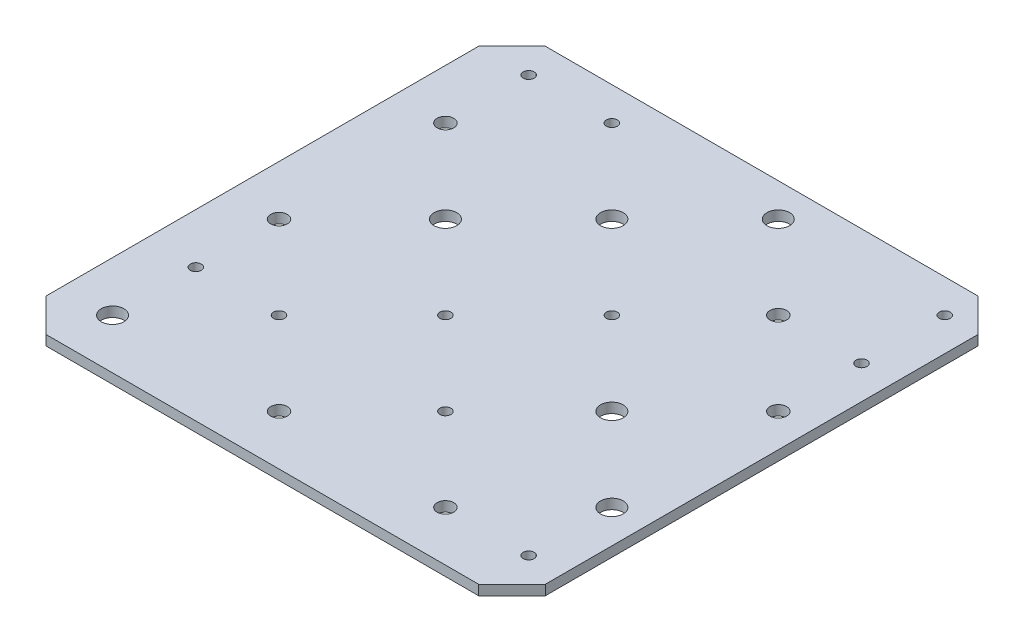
ISO-10303-21;
HEADER;
FILE_DESCRIPTION(('STEP AP214'),'2;1');
FILE_NAME('part.step','',(''),(''),'','','');
FILE_SCHEMA(('AUTOMOTIVE_DESIGN { 1 0 10303 214 1 1 1 1 }'));
ENDSEC;
DATA;
#1=APPLICATION_CONTEXT('core data for automotive mechanical design processes');
#2=APPLICATION_PROTOCOL_DEFINITION('international standard','automotive_design',2000,#1);
#3=PRODUCT_CONTEXT('',#1,'mechanical');
#4=PRODUCT('Part','Part','',(#3));
#5=PRODUCT_RELATED_PRODUCT_CATEGORY('part','',(#4));
#6=PRODUCT_DEFINITION_FORMATION('','',#4);
#7=PRODUCT_DEFINITION_CONTEXT('part definition',#1,'design');
#8=PRODUCT_DEFINITION('design','',#6,#7);
#9=PRODUCT_DEFINITION_SHAPE('','',#8);
#10=(LENGTH_UNIT() NAMED_UNIT(*) SI_UNIT(.MILLI.,.METRE.));
#11=(NAMED_UNIT(*) PLANE_ANGLE_UNIT() SI_UNIT($,.RADIAN.));
#12=(NAMED_UNIT(*) SI_UNIT($,.STERADIAN.) SOLID_ANGLE_UNIT());
#13=UNCERTAINTY_MEASURE_WITH_UNIT(LENGTH_MEASURE(1.E-05),#10,'distance_accuracy_value','');
#14=(GEOMETRIC_REPRESENTATION_CONTEXT(3) GLOBAL_UNCERTAINTY_ASSIGNED_CONTEXT((#13)) GLOBAL_UNIT_ASSIGNED_CONTEXT((#10,
#11,#12)) REPRESENTATION_CONTEXT('',''));
#15=CARTESIAN_POINT('',(0.,0.,0.));
#16=DIRECTION('',(0.,0.,1.));
#17=DIRECTION('',(1.,0.,0.));
#18=AXIS2_PLACEMENT_3D('',#15,#16,#17);
#19=CARTESIAN_POINT('',(75.,3.,75.));
#20=DIRECTION('',(-1.,0.,0.));
#21=DIRECTION('',(0.,0.,1.));
#22=AXIS2_PLACEMENT_3D('',#19,#20,#21);
#23=PLANE('',#22);
#24=DIRECTION('',(0.,0.,-1.));
#25=VECTOR('',#24,1.);
#26=CARTESIAN_POINT('',(75.,0.,75.));
#27=LINE('',#26,#25);
#28=CARTESIAN_POINT('',(75.,0.,65.));
#29=VERTEX_POINT('',#28);
#30=CARTESIAN_POINT('',(75.,0.,-64.9999999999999));
#31=VERTEX_POINT('',#30);
#32=EDGE_CURVE('E141',#29,#31,#27,.T.);
#33=ORIENTED_EDGE('',*,*,#32,.T.);
#34=DIRECTION('',(0.,1.,0.));
#35=VECTOR('',#34,1.);
#36=CARTESIAN_POINT('',(75.,3.,-64.9999999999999));
#37=LINE('',#36,#35);
#38=CARTESIAN_POINT('',(75.,3.,-64.9999999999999));
#39=VERTEX_POINT('',#38);
#40=EDGE_CURVE('E11',#31,#39,#37,.T.);
#41=ORIENTED_EDGE('',*,*,#40,.T.);
#42=DIRECTION('',(0.,0.,-1.));
#43=VECTOR('',#42,1.);
#44=CARTESIAN_POINT('',(75.,3.,75.));
#45=LINE('',#44,#43);
#46=CARTESIAN_POINT('',(75.,3.,65.));
#47=VERTEX_POINT('',#46);
#48=EDGE_CURVE('E139',#47,#39,#45,.T.);
#49=ORIENTED_EDGE('',*,*,#48,.F.);
#50=DIRECTION('',(0.,-1.,0.));
#51=VECTOR('',#50,1.);
#52=CARTESIAN_POINT('',(75.,3.,65.));
#53=LINE('',#52,#51);
#54=EDGE_CURVE('E48',#47,#29,#53,.T.);
#55=ORIENTED_EDGE('',*,*,#54,.T.);
#56=EDGE_LOOP('',(#33,#41,#49,#55));
#57=FACE_BOUND('',#56,.T.);
#58=ADVANCED_FACE('F39',(#57),#23,.F.);
#59=CARTESIAN_POINT('',(-75.,3.,-75.));
#60=DIRECTION('',(0.,0.,1.));
#61=DIRECTION('',(1.,0.,0.));
#62=AXIS2_PLACEMENT_3D('',#59,#60,#61);
#63=PLANE('',#62);
#64=DIRECTION('',(-1.,0.,0.));
#65=VECTOR('',#64,1.);
#66=CARTESIAN_POINT('',(-75.,0.,-75.));
#67=LINE('',#66,#65);
#68=CARTESIAN_POINT('',(65.,0.,-75.));
#69=VERTEX_POINT('',#68);
#70=CARTESIAN_POINT('',(-64.9999999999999,0.,-75.));
#71=VERTEX_POINT('',#70);
#72=EDGE_CURVE('E135',#69,#71,#67,.T.);
#73=ORIENTED_EDGE('',*,*,#72,.T.);
#74=DIRECTION('',(0.,1.,0.));
#75=VECTOR('',#74,1.);
#76=CARTESIAN_POINT('',(-64.9999999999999,3.,-75.));
#77=LINE('',#76,#75);
#78=CARTESIAN_POINT('',(-64.9999999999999,3.,-75.));
#79=VERTEX_POINT('',#78);
#80=EDGE_CURVE('E111',#71,#79,#77,.T.);
#81=ORIENTED_EDGE('',*,*,#80,.T.);
#82=DIRECTION('',(-1.,0.,0.));
#83=VECTOR('',#82,1.);
#84=CARTESIAN_POINT('',(-75.,3.,-75.));
#85=LINE('',#84,#83);
#86=CARTESIAN_POINT('',(65.,3.,-75.));
#87=VERTEX_POINT('',#86);
#88=EDGE_CURVE('E198',#87,#79,#85,.T.);
#89=ORIENTED_EDGE('',*,*,#88,.F.);
#90=DIRECTION('',(0.,-1.,0.));
#91=VECTOR('',#90,1.);
#92=CARTESIAN_POINT('',(65.,3.,-75.));
#93=LINE('',#92,#91);
#94=EDGE_CURVE('E117',#87,#69,#93,.T.);
#95=ORIENTED_EDGE('',*,*,#94,.T.);
#96=EDGE_LOOP('',(#73,#81,#89,#95));
#97=FACE_BOUND('',#96,.T.);
#98=ADVANCED_FACE('F428',(#97),#63,.F.);
#99=CARTESIAN_POINT('',(-75.,3.,75.));
#100=DIRECTION('',(1.,0.,0.));
#101=DIRECTION('',(0.,0.,-1.));
#102=AXIS2_PLACEMENT_3D('',#99,#100,#101);
#103=PLANE('',#102);
#104=DIRECTION('',(0.,0.,1.));
#105=VECTOR('',#104,1.);
#106=CARTESIAN_POINT('',(-75.,3.,75.));
#107=LINE('',#106,#105);
#108=CARTESIAN_POINT('',(-75.,3.,-65.));
#109=VERTEX_POINT('',#108);
#110=CARTESIAN_POINT('',(-75.,3.,64.9999999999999));
#111=VERTEX_POINT('',#110);
#112=EDGE_CURVE('E126',#109,#111,#107,.T.);
#113=ORIENTED_EDGE('',*,*,#112,.F.);
#114=DIRECTION('',(0.,-1.,0.));
#115=VECTOR('',#114,1.);
#116=CARTESIAN_POINT('',(-75.,3.,-65.));
#117=LINE('',#116,#115);
#118=CARTESIAN_POINT('',(-75.,0.,-65.));
#119=VERTEX_POINT('',#118);
#120=EDGE_CURVE('E110',#109,#119,#117,.T.);
#121=ORIENTED_EDGE('',*,*,#120,.T.);
#122=DIRECTION('',(0.,0.,1.));
#123=VECTOR('',#122,1.);
#124=CARTESIAN_POINT('',(-75.,0.,75.));
#125=LINE('',#124,#123);
#126=CARTESIAN_POINT('',(-75.,0.,64.9999999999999));
#127=VERTEX_POINT('',#126);
#128=EDGE_CURVE('E124',#119,#127,#125,.T.);
#129=ORIENTED_EDGE('',*,*,#128,.T.);
#130=DIRECTION('',(0.,1.,0.));
#131=VECTOR('',#130,1.);
#132=CARTESIAN_POINT('',(-75.,3.,64.9999999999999));
#133=LINE('',#132,#131);
#134=EDGE_CURVE('E129',#127,#111,#133,.T.);
#135=ORIENTED_EDGE('',*,*,#134,.T.);
#136=EDGE_LOOP('',(#113,#121,#129,#135));
#137=FACE_BOUND('',#136,.T.);
#138=ADVANCED_FACE('F123',(#137),#103,.F.);
#139=CARTESIAN_POINT('',(-75.,3.,75.));
#140=DIRECTION('',(0.,0.,-1.));
#141=DIRECTION('',(-1.,0.,0.));
#142=AXIS2_PLACEMENT_3D('',#139,#140,#141);
#143=PLANE('',#142);
#144=DIRECTION('',(1.,0.,0.));
#145=VECTOR('',#144,1.);
#146=CARTESIAN_POINT('',(-75.,3.,75.));
#147=LINE('',#146,#145);
#148=CARTESIAN_POINT('',(-65.,3.,75.));
#149=VERTEX_POINT('',#148);
#150=CARTESIAN_POINT('',(64.9999999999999,3.,75.));
#151=VERTEX_POINT('',#150);
#152=EDGE_CURVE('E146',#149,#151,#147,.T.);
#153=ORIENTED_EDGE('',*,*,#152,.F.);
#154=DIRECTION('',(0.,-1.,0.));
#155=VECTOR('',#154,1.);
#156=CARTESIAN_POINT('',(-65.,3.,75.));
#157=LINE('',#156,#155);
#158=CARTESIAN_POINT('',(-65.,0.,75.));
#159=VERTEX_POINT('',#158);
#160=EDGE_CURVE('E173',#149,#159,#157,.T.);
#161=ORIENTED_EDGE('',*,*,#160,.T.);
#162=DIRECTION('',(1.,0.,0.));
#163=VECTOR('',#162,1.);
#164=CARTESIAN_POINT('',(-75.,0.,75.));
#165=LINE('',#164,#163);
#166=CARTESIAN_POINT('',(64.9999999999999,0.,75.));
#167=VERTEX_POINT('',#166);
#168=EDGE_CURVE('E134',#159,#167,#165,.T.);
#169=ORIENTED_EDGE('',*,*,#168,.T.);
#170=DIRECTION('',(0.,1.,0.));
#171=VECTOR('',#170,1.);
#172=CARTESIAN_POINT('',(64.9999999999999,3.,75.));
#173=LINE('',#172,#171);
#174=EDGE_CURVE('E55',#167,#151,#173,.T.);
#175=ORIENTED_EDGE('',*,*,#174,.T.);
#176=EDGE_LOOP('',(#153,#161,#169,#175));
#177=FACE_BOUND('',#176,.T.);
#178=ADVANCED_FACE('F381',(#177),#143,.F.);
#179=CARTESIAN_POINT('',(0.,3.,0.));
#180=DIRECTION('',(0.,-1.,0.));
#181=DIRECTION('',(0.,0.,-1.));
#182=AXIS2_PLACEMENT_3D('',#179,#180,#181);
#183=PLANE('',#182);
#184=CARTESIAN_POINT('',(-60.,3.,-65.));
#185=DIRECTION('',(0.,1.,0.));
#186=DIRECTION('',(0.,0.,1.));
#187=AXIS2_PLACEMENT_3D('',#184,#185,#186);
#188=CIRCLE('',#187,1.65);
#189=CARTESIAN_POINT('',(-60.,3.,-63.35));
#190=VERTEX_POINT('',#189);
#191=EDGE_CURVE('E371',#190,#190,#188,.T.);
#192=ORIENTED_EDGE('',*,*,#191,.F.);
#193=EDGE_LOOP('',(#192));
#194=FACE_BOUND('',#193,.T.);
#195=CARTESIAN_POINT('',(65.,3.,-40.));
#196=DIRECTION('',(0.,1.,0.));
#197=DIRECTION('',(0.,0.,1.));
#198=AXIS2_PLACEMENT_3D('',#195,#196,#197);
#199=CIRCLE('',#198,1.65);
#200=CARTESIAN_POINT('',(65.,3.,-38.35));
#201=VERTEX_POINT('',#200);
#202=EDGE_CURVE('E363',#201,#201,#199,.T.);
#203=ORIENTED_EDGE('',*,*,#202,.F.);
#204=EDGE_LOOP('',(#203));
#205=FACE_BOUND('',#204,.T.);
#206=CARTESIAN_POINT('',(-60.,3.,35.));
#207=DIRECTION('',(0.,1.,0.));
#208=DIRECTION('',(0.,0.,1.));
#209=AXIS2_PLACEMENT_3D('',#206,#207,#208);
#210=CIRCLE('',#209,1.65);
#211=CARTESIAN_POINT('',(-60.,3.,36.65));
#212=VERTEX_POINT('',#211);
#213=EDGE_CURVE('E355',#212,#212,#210,.T.);
#214=ORIENTED_EDGE('',*,*,#213,.F.);
#215=EDGE_LOOP('',(#214));
#216=FACE_BOUND('',#215,.T.);
#217=CARTESIAN_POINT('',(65.,3.,60.));
#218=DIRECTION('',(0.,1.,0.));
#219=DIRECTION('',(0.,0.,1.));
#220=AXIS2_PLACEMENT_3D('',#217,#218,#219);
#221=CIRCLE('',#220,1.65);
#222=CARTESIAN_POINT('',(65.,3.,61.65));
#223=VERTEX_POINT('',#222);
#224=EDGE_CURVE('E347',#223,#223,#221,.T.);
#225=ORIENTED_EDGE('',*,*,#224,.F.);
#226=EDGE_LOOP('',(#225));
#227=FACE_BOUND('',#226,.T.);
#228=CARTESIAN_POINT('',(65.,3.,35.));
#229=DIRECTION('',(0.,1.,0.));
#230=DIRECTION('',(0.,0.,1.));
#231=AXIS2_PLACEMENT_3D('',#228,#229,#230);
#232=CIRCLE('',#231,3.4);
#233=CARTESIAN_POINT('',(65.,3.,38.4));
#234=VERTEX_POINT('',#233);
#235=EDGE_CURVE('E339',#234,#234,#232,.T.);
#236=ORIENTED_EDGE('',*,*,#235,.F.);
#237=EDGE_LOOP('',(#236));
#238=FACE_BOUND('',#237,.T.);
#239=CARTESIAN_POINT('',(40.,3.,9.99999999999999));
#240=DIRECTION('',(0.,1.,0.));
#241=DIRECTION('',(0.,0.,1.));
#242=AXIS2_PLACEMENT_3D('',#239,#240,#241);
#243=CIRCLE('',#242,3.4);
#244=CARTESIAN_POINT('',(40.,3.,13.4));
#245=VERTEX_POINT('',#244);
#246=EDGE_CURVE('E331',#245,#245,#243,.T.);
#247=ORIENTED_EDGE('',*,*,#246,.F.);
#248=EDGE_LOOP('',(#247));
#249=FACE_BOUND('',#248,.T.);
#250=CARTESIAN_POINT('',(-10.,3.,-40.));
#251=DIRECTION('',(0.,1.,0.));
#252=DIRECTION('',(0.,0.,1.));
#253=AXIS2_PLACEMENT_3D('',#250,#251,#252);
#254=CIRCLE('',#253,3.4);
#255=CARTESIAN_POINT('',(-10.,3.,-36.6));
#256=VERTEX_POINT('',#255);
#257=EDGE_CURVE('E323',#256,#256,#254,.T.);
#258=ORIENTED_EDGE('',*,*,#257,.F.);
#259=EDGE_LOOP('',(#258));
#260=FACE_BOUND('',#259,.T.);
#261=CARTESIAN_POINT('',(15.,3.,-65.));
#262=DIRECTION('',(0.,1.,0.));
#263=DIRECTION('',(0.,0.,1.));
#264=AXIS2_PLACEMENT_3D('',#261,#262,#263);
#265=CIRCLE('',#264,3.4);
#266=CARTESIAN_POINT('',(15.,3.,-61.6));
#267=VERTEX_POINT('',#266);
#268=EDGE_CURVE('E315',#267,#267,#265,.T.);
#269=ORIENTED_EDGE('',*,*,#268,.F.);
#270=EDGE_LOOP('',(#269));
#271=FACE_BOUND('',#270,.T.);
#272=CARTESIAN_POINT('',(-60.,3.,60.));
#273=DIRECTION('',(0.,1.,0.));
#274=DIRECTION('',(0.,0.,1.));
#275=AXIS2_PLACEMENT_3D('',#272,#273,#274);
#276=CIRCLE('',#275,3.4);
#277=CARTESIAN_POINT('',(-60.,3.,63.4));
#278=VERTEX_POINT('',#277);
#279=EDGE_CURVE('E307',#278,#278,#276,.T.);
#280=ORIENTED_EDGE('',*,*,#279,.F.);
#281=EDGE_LOOP('',(#280));
#282=FACE_BOUND('',#281,.T.);
#283=CARTESIAN_POINT('',(-35.,3.,-15.));
#284=DIRECTION('',(0.,1.,0.));
#285=DIRECTION('',(0.,0.,1.));
#286=AXIS2_PLACEMENT_3D('',#283,#284,#285);
#287=CIRCLE('',#286,3.4);
#288=CARTESIAN_POINT('',(-35.,3.,-11.6));
#289=VERTEX_POINT('',#288);
#290=EDGE_CURVE('E299',#289,#289,#287,.T.);
#291=ORIENTED_EDGE('',*,*,#290,.F.);
#292=EDGE_LOOP('',(#291));
#293=FACE_BOUND('',#292,.T.);
#294=CARTESIAN_POINT('',(40.,3.,-40.));
#295=DIRECTION('',(0.,1.,0.));
#296=DIRECTION('',(0.,0.,1.));
#297=AXIS2_PLACEMENT_3D('',#294,#295,#296);
#298=CIRCLE('',#297,2.5);
#299=CARTESIAN_POINT('',(40.,3.,-37.5));
#300=VERTEX_POINT('',#299);
#301=EDGE_CURVE('E291',#300,#300,#298,.T.);
#302=ORIENTED_EDGE('',*,*,#301,.F.);
#303=EDGE_LOOP('',(#302));
#304=FACE_BOUND('',#303,.T.);
#305=CARTESIAN_POINT('',(-60.,3.,-40.));
#306=DIRECTION('',(0.,1.,0.));
#307=DIRECTION('',(0.,0.,1.));
#308=AXIS2_PLACEMENT_3D('',#305,#306,#307);
#309=CIRCLE('',#308,2.5);
#310=CARTESIAN_POINT('',(-60.,3.,-37.5));
#311=VERTEX_POINT('',#310);
#312=EDGE_CURVE('E283',#311,#311,#309,.T.);
#313=ORIENTED_EDGE('',*,*,#312,.F.);
#314=EDGE_LOOP('',(#313));
#315=FACE_BOUND('',#314,.T.);
#316=CARTESIAN_POINT('',(65.,3.,-15.));
#317=DIRECTION('',(0.,1.,0.));
#318=DIRECTION('',(0.,0.,1.));
#319=AXIS2_PLACEMENT_3D('',#316,#317,#318);
#320=CIRCLE('',#319,2.5);
#321=CARTESIAN_POINT('',(65.,3.,-12.5));
#322=VERTEX_POINT('',#321);
#323=EDGE_CURVE('E275',#322,#322,#320,.T.);
#324=ORIENTED_EDGE('',*,*,#323,.F.);
#325=EDGE_LOOP('',(#324));
#326=FACE_BOUND('',#325,.T.);
#327=CARTESIAN_POINT('',(40.,3.,60.));
#328=DIRECTION('',(0.,1.,0.));
#329=DIRECTION('',(0.,0.,1.));
#330=AXIS2_PLACEMENT_3D('',#327,#328,#329);
#331=CIRCLE('',#330,2.5);
#332=CARTESIAN_POINT('',(40.,3.,62.5));
#333=VERTEX_POINT('',#332);
#334=EDGE_CURVE('E267',#333,#333,#331,.T.);
#335=ORIENTED_EDGE('',*,*,#334,.F.);
#336=EDGE_LOOP('',(#335));
#337=FACE_BOUND('',#336,.T.);
#338=CARTESIAN_POINT('',(-10.,3.,60.));
#339=DIRECTION('',(0.,1.,0.));
#340=DIRECTION('',(0.,0.,1.));
#341=AXIS2_PLACEMENT_3D('',#338,#339,#340);
#342=CIRCLE('',#341,2.5);
#343=CARTESIAN_POINT('',(-10.,3.,62.5));
#344=VERTEX_POINT('',#343);
#345=EDGE_CURVE('E259',#344,#344,#342,.T.);
#346=ORIENTED_EDGE('',*,*,#345,.F.);
#347=EDGE_LOOP('',(#346));
#348=FACE_BOUND('',#347,.T.);
#349=CARTESIAN_POINT('',(-60.,3.,10.));
#350=DIRECTION('',(0.,1.,0.));
#351=DIRECTION('',(0.,0.,1.));
#352=AXIS2_PLACEMENT_3D('',#349,#350,#351);
#353=CIRCLE('',#352,2.5);
#354=CARTESIAN_POINT('',(-60.,3.,12.5));
#355=VERTEX_POINT('',#354);
#356=EDGE_CURVE('E251',#355,#355,#353,.T.);
#357=ORIENTED_EDGE('',*,*,#356,.F.);
#358=EDGE_LOOP('',(#357));
#359=FACE_BOUND('',#358,.T.);
#360=CARTESIAN_POINT('',(-35.,3.,-65.));
#361=DIRECTION('',(0.,1.,0.));
#362=DIRECTION('',(0.,0.,1.));
#363=AXIS2_PLACEMENT_3D('',#360,#361,#362);
#364=CIRCLE('',#363,1.65);
#365=CARTESIAN_POINT('',(-35.,3.,-63.35));
#366=VERTEX_POINT('',#365);
#367=EDGE_CURVE('E243',#366,#366,#364,.T.);
#368=ORIENTED_EDGE('',*,*,#367,.F.);
#369=EDGE_LOOP('',(#368));
#370=FACE_BOUND('',#369,.T.);
#371=CARTESIAN_POINT('',(65.,3.,-65.));
#372=DIRECTION('',(0.,1.,0.));
#373=DIRECTION('',(0.,0.,1.));
#374=AXIS2_PLACEMENT_3D('',#371,#372,#373);
#375=CIRCLE('',#374,1.65);
#376=CARTESIAN_POINT('',(65.,3.,-63.35));
#377=VERTEX_POINT('',#376);
#378=EDGE_CURVE('E235',#377,#377,#375,.T.);
#379=ORIENTED_EDGE('',*,*,#378,.F.);
#380=EDGE_LOOP('',(#379));
#381=FACE_BOUND('',#380,.T.);
#382=CARTESIAN_POINT('',(15.,3.,-15.));
#383=DIRECTION('',(0.,1.,0.));
#384=DIRECTION('',(0.,0.,1.));
#385=AXIS2_PLACEMENT_3D('',#382,#383,#384);
#386=CIRCLE('',#385,1.65);
#387=CARTESIAN_POINT('',(15.,3.,-13.35));
#388=VERTEX_POINT('',#387);
#389=EDGE_CURVE('E227',#388,#388,#386,.T.);
#390=ORIENTED_EDGE('',*,*,#389,.F.);
#391=EDGE_LOOP('',(#390));
#392=FACE_BOUND('',#391,.T.);
#393=CARTESIAN_POINT('',(-35.,3.,35.));
#394=DIRECTION('',(0.,1.,0.));
#395=DIRECTION('',(0.,0.,1.));
#396=AXIS2_PLACEMENT_3D('',#393,#394,#395);
#397=CIRCLE('',#396,1.65);
#398=CARTESIAN_POINT('',(-35.,3.,36.65));
#399=VERTEX_POINT('',#398);
#400=EDGE_CURVE('E219',#399,#399,#397,.T.);
#401=ORIENTED_EDGE('',*,*,#400,.F.);
#402=EDGE_LOOP('',(#401));
#403=FACE_BOUND('',#402,.T.);
#404=CARTESIAN_POINT('',(-10.,3.,10.));
#405=DIRECTION('',(0.,1.,0.));
#406=DIRECTION('',(0.,0.,1.));
#407=AXIS2_PLACEMENT_3D('',#404,#405,#406);
#408=CIRCLE('',#407,1.65);
#409=CARTESIAN_POINT('',(-10.,3.,11.65));
#410=VERTEX_POINT('',#409);
#411=EDGE_CURVE('E211',#410,#410,#408,.T.);
#412=ORIENTED_EDGE('',*,*,#411,.F.);
#413=EDGE_LOOP('',(#412));
#414=FACE_BOUND('',#413,.T.);
#415=CARTESIAN_POINT('',(15.,3.,35.));
#416=DIRECTION('',(0.,1.,0.));
#417=DIRECTION('',(0.,0.,1.));
#418=AXIS2_PLACEMENT_3D('',#415,#416,#417);
#419=CIRCLE('',#418,1.65);
#420=CARTESIAN_POINT('',(15.,3.,36.65));
#421=VERTEX_POINT('',#420);
#422=EDGE_CURVE('E191',#421,#421,#419,.T.);
#423=ORIENTED_EDGE('',*,*,#422,.F.);
#424=EDGE_LOOP('',(#423));
#425=FACE_BOUND('',#424,.T.);
#426=ORIENTED_EDGE('',*,*,#88,.T.);
#427=DIRECTION('',(0.707106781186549,0.,-0.707106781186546));
#428=VECTOR('',#427,1.);
#429=CARTESIAN_POINT('',(-75.,3.,-65.));
#430=LINE('',#429,#428);
#431=EDGE_CURVE('E168',#79,#109,#430,.F.);
#432=ORIENTED_EDGE('',*,*,#431,.T.);
#433=ORIENTED_EDGE('',*,*,#112,.T.);
#434=DIRECTION('',(-0.707106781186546,0.,-0.707106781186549));
#435=VECTOR('',#434,1.);
#436=CARTESIAN_POINT('',(-65.,3.,75.));
#437=LINE('',#436,#435);
#438=EDGE_CURVE('E62',#111,#149,#437,.F.);
#439=ORIENTED_EDGE('',*,*,#438,.T.);
#440=ORIENTED_EDGE('',*,*,#152,.T.);
#441=DIRECTION('',(-0.707106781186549,0.,0.707106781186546));
#442=VECTOR('',#441,1.);
#443=CARTESIAN_POINT('',(75.,3.,65.));
#444=LINE('',#443,#442);
#445=EDGE_CURVE('E160',#151,#47,#444,.F.);
#446=ORIENTED_EDGE('',*,*,#445,.T.);
#447=ORIENTED_EDGE('',*,*,#48,.T.);
#448=DIRECTION('',(0.707106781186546,0.,0.707106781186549));
#449=VECTOR('',#448,1.);
#450=CARTESIAN_POINT('',(65.,3.,-75.));
#451=LINE('',#450,#449);
#452=EDGE_CURVE('E163',#39,#87,#451,.F.);
#453=ORIENTED_EDGE('',*,*,#452,.T.);
#454=EDGE_LOOP('',(#426,#432,#433,#439,#440,#446,#447,#453));
#455=FACE_BOUND('',#454,.T.);
#456=ADVANCED_FACE('F378',(#194,#205,#216,#227,#238,#249,#260,#271,#282,#293,#304,#315,#326,
#337,#348,#359,#370,#381,#392,#403,#414,#425,#455),#183,.F.);
#457=CARTESIAN_POINT('',(0.,0.,0.));
#458=DIRECTION('',(0.,-1.,0.));
#459=DIRECTION('',(0.,0.,-1.));
#460=AXIS2_PLACEMENT_3D('',#457,#458,#459);
#461=PLANE('',#460);
#462=CARTESIAN_POINT('',(-60.,0.,-65.));
#463=DIRECTION('',(0.,1.,0.));
#464=DIRECTION('',(0.,0.,1.));
#465=AXIS2_PLACEMENT_3D('',#462,#463,#464);
#466=CIRCLE('',#465,1.65);
#467=CARTESIAN_POINT('',(-60.,0.,-63.35));
#468=VERTEX_POINT('',#467);
#469=EDGE_CURVE('E367',#468,#468,#466,.T.);
#470=ORIENTED_EDGE('',*,*,#469,.T.);
#471=EDGE_LOOP('',(#470));
#472=FACE_BOUND('',#471,.T.);
#473=CARTESIAN_POINT('',(65.,0.,-40.));
#474=DIRECTION('',(0.,1.,0.));
#475=DIRECTION('',(0.,0.,1.));
#476=AXIS2_PLACEMENT_3D('',#473,#474,#475);
#477=CIRCLE('',#476,1.65);
#478=CARTESIAN_POINT('',(65.,0.,-38.35));
#479=VERTEX_POINT('',#478);
#480=EDGE_CURVE('E359',#479,#479,#477,.T.);
#481=ORIENTED_EDGE('',*,*,#480,.T.);
#482=EDGE_LOOP('',(#481));
#483=FACE_BOUND('',#482,.T.);
#484=CARTESIAN_POINT('',(-60.,0.,35.));
#485=DIRECTION('',(0.,1.,0.));
#486=DIRECTION('',(0.,0.,1.));
#487=AXIS2_PLACEMENT_3D('',#484,#485,#486);
#488=CIRCLE('',#487,1.65);
#489=CARTESIAN_POINT('',(-60.,0.,36.65));
#490=VERTEX_POINT('',#489);
#491=EDGE_CURVE('E351',#490,#490,#488,.T.);
#492=ORIENTED_EDGE('',*,*,#491,.T.);
#493=EDGE_LOOP('',(#492));
#494=FACE_BOUND('',#493,.T.);
#495=CARTESIAN_POINT('',(65.,0.,60.));
#496=DIRECTION('',(0.,1.,0.));
#497=DIRECTION('',(0.,0.,1.));
#498=AXIS2_PLACEMENT_3D('',#495,#496,#497);
#499=CIRCLE('',#498,1.65);
#500=CARTESIAN_POINT('',(65.,0.,61.65));
#501=VERTEX_POINT('',#500);
#502=EDGE_CURVE('E343',#501,#501,#499,.T.);
#503=ORIENTED_EDGE('',*,*,#502,.T.);
#504=EDGE_LOOP('',(#503));
#505=FACE_BOUND('',#504,.T.);
#506=CARTESIAN_POINT('',(65.,0.,35.));
#507=DIRECTION('',(0.,1.,0.));
#508=DIRECTION('',(0.,0.,1.));
#509=AXIS2_PLACEMENT_3D('',#506,#507,#508);
#510=CIRCLE('',#509,3.4);
#511=CARTESIAN_POINT('',(65.,0.,38.4));
#512=VERTEX_POINT('',#511);
#513=EDGE_CURVE('E335',#512,#512,#510,.T.);
#514=ORIENTED_EDGE('',*,*,#513,.T.);
#515=EDGE_LOOP('',(#514));
#516=FACE_BOUND('',#515,.T.);
#517=CARTESIAN_POINT('',(40.,0.,9.99999999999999));
#518=DIRECTION('',(0.,1.,0.));
#519=DIRECTION('',(0.,0.,1.));
#520=AXIS2_PLACEMENT_3D('',#517,#518,#519);
#521=CIRCLE('',#520,3.4);
#522=CARTESIAN_POINT('',(40.,0.,13.4));
#523=VERTEX_POINT('',#522);
#524=EDGE_CURVE('E327',#523,#523,#521,.T.);
#525=ORIENTED_EDGE('',*,*,#524,.T.);
#526=EDGE_LOOP('',(#525));
#527=FACE_BOUND('',#526,.T.);
#528=CARTESIAN_POINT('',(-10.,0.,-40.));
#529=DIRECTION('',(0.,1.,0.));
#530=DIRECTION('',(0.,0.,1.));
#531=AXIS2_PLACEMENT_3D('',#528,#529,#530);
#532=CIRCLE('',#531,3.4);
#533=CARTESIAN_POINT('',(-10.,0.,-36.6));
#534=VERTEX_POINT('',#533);
#535=EDGE_CURVE('E319',#534,#534,#532,.T.);
#536=ORIENTED_EDGE('',*,*,#535,.T.);
#537=EDGE_LOOP('',(#536));
#538=FACE_BOUND('',#537,.T.);
#539=CARTESIAN_POINT('',(15.,0.,-65.));
#540=DIRECTION('',(0.,1.,0.));
#541=DIRECTION('',(0.,0.,1.));
#542=AXIS2_PLACEMENT_3D('',#539,#540,#541);
#543=CIRCLE('',#542,3.4);
#544=CARTESIAN_POINT('',(15.,0.,-61.6));
#545=VERTEX_POINT('',#544);
#546=EDGE_CURVE('E311',#545,#545,#543,.T.);
#547=ORIENTED_EDGE('',*,*,#546,.T.);
#548=EDGE_LOOP('',(#547));
#549=FACE_BOUND('',#548,.T.);
#550=CARTESIAN_POINT('',(-60.,0.,60.));
#551=DIRECTION('',(0.,1.,0.));
#552=DIRECTION('',(0.,0.,1.));
#553=AXIS2_PLACEMENT_3D('',#550,#551,#552);
#554=CIRCLE('',#553,3.4);
#555=CARTESIAN_POINT('',(-60.,0.,63.4));
#556=VERTEX_POINT('',#555);
#557=EDGE_CURVE('E303',#556,#556,#554,.T.);
#558=ORIENTED_EDGE('',*,*,#557,.T.);
#559=EDGE_LOOP('',(#558));
#560=FACE_BOUND('',#559,.T.);
#561=CARTESIAN_POINT('',(-35.,0.,-15.));
#562=DIRECTION('',(0.,1.,0.));
#563=DIRECTION('',(0.,0.,1.));
#564=AXIS2_PLACEMENT_3D('',#561,#562,#563);
#565=CIRCLE('',#564,3.4);
#566=CARTESIAN_POINT('',(-35.,0.,-11.6));
#567=VERTEX_POINT('',#566);
#568=EDGE_CURVE('E295',#567,#567,#565,.T.);
#569=ORIENTED_EDGE('',*,*,#568,.T.);
#570=EDGE_LOOP('',(#569));
#571=FACE_BOUND('',#570,.T.);
#572=CARTESIAN_POINT('',(40.,0.,-40.));
#573=DIRECTION('',(0.,1.,0.));
#574=DIRECTION('',(0.,0.,1.));
#575=AXIS2_PLACEMENT_3D('',#572,#573,#574);
#576=CIRCLE('',#575,2.5);
#577=CARTESIAN_POINT('',(40.,0.,-37.5));
#578=VERTEX_POINT('',#577);
#579=EDGE_CURVE('E287',#578,#578,#576,.T.);
#580=ORIENTED_EDGE('',*,*,#579,.T.);
#581=EDGE_LOOP('',(#580));
#582=FACE_BOUND('',#581,.T.);
#583=CARTESIAN_POINT('',(-60.,0.,-40.));
#584=DIRECTION('',(0.,1.,0.));
#585=DIRECTION('',(0.,0.,1.));
#586=AXIS2_PLACEMENT_3D('',#583,#584,#585);
#587=CIRCLE('',#586,2.5);
#588=CARTESIAN_POINT('',(-60.,0.,-37.5));
#589=VERTEX_POINT('',#588);
#590=EDGE_CURVE('E279',#589,#589,#587,.T.);
#591=ORIENTED_EDGE('',*,*,#590,.T.);
#592=EDGE_LOOP('',(#591));
#593=FACE_BOUND('',#592,.T.);
#594=CARTESIAN_POINT('',(65.,0.,-15.));
#595=DIRECTION('',(0.,1.,0.));
#596=DIRECTION('',(0.,0.,1.));
#597=AXIS2_PLACEMENT_3D('',#594,#595,#596);
#598=CIRCLE('',#597,2.5);
#599=CARTESIAN_POINT('',(65.,0.,-12.5));
#600=VERTEX_POINT('',#599);
#601=EDGE_CURVE('E271',#600,#600,#598,.T.);
#602=ORIENTED_EDGE('',*,*,#601,.T.);
#603=EDGE_LOOP('',(#602));
#604=FACE_BOUND('',#603,.T.);
#605=CARTESIAN_POINT('',(40.,0.,60.));
#606=DIRECTION('',(0.,1.,0.));
#607=DIRECTION('',(0.,0.,1.));
#608=AXIS2_PLACEMENT_3D('',#605,#606,#607);
#609=CIRCLE('',#608,2.5);
#610=CARTESIAN_POINT('',(40.,0.,62.5));
#611=VERTEX_POINT('',#610);
#612=EDGE_CURVE('E263',#611,#611,#609,.T.);
#613=ORIENTED_EDGE('',*,*,#612,.T.);
#614=EDGE_LOOP('',(#613));
#615=FACE_BOUND('',#614,.T.);
#616=CARTESIAN_POINT('',(-10.,0.,60.));
#617=DIRECTION('',(0.,1.,0.));
#618=DIRECTION('',(0.,0.,1.));
#619=AXIS2_PLACEMENT_3D('',#616,#617,#618);
#620=CIRCLE('',#619,2.5);
#621=CARTESIAN_POINT('',(-10.,0.,62.5));
#622=VERTEX_POINT('',#621);
#623=EDGE_CURVE('E255',#622,#622,#620,.T.);
#624=ORIENTED_EDGE('',*,*,#623,.T.);
#625=EDGE_LOOP('',(#624));
#626=FACE_BOUND('',#625,.T.);
#627=CARTESIAN_POINT('',(-60.,0.,10.));
#628=DIRECTION('',(0.,1.,0.));
#629=DIRECTION('',(0.,0.,1.));
#630=AXIS2_PLACEMENT_3D('',#627,#628,#629);
#631=CIRCLE('',#630,2.5);
#632=CARTESIAN_POINT('',(-60.,0.,12.5));
#633=VERTEX_POINT('',#632);
#634=EDGE_CURVE('E247',#633,#633,#631,.T.);
#635=ORIENTED_EDGE('',*,*,#634,.T.);
#636=EDGE_LOOP('',(#635));
#637=FACE_BOUND('',#636,.T.);
#638=CARTESIAN_POINT('',(-35.,0.,-65.));
#639=DIRECTION('',(0.,1.,0.));
#640=DIRECTION('',(0.,0.,1.));
#641=AXIS2_PLACEMENT_3D('',#638,#639,#640);
#642=CIRCLE('',#641,1.65);
#643=CARTESIAN_POINT('',(-35.,0.,-63.35));
#644=VERTEX_POINT('',#643);
#645=EDGE_CURVE('E239',#644,#644,#642,.T.);
#646=ORIENTED_EDGE('',*,*,#645,.T.);
#647=EDGE_LOOP('',(#646));
#648=FACE_BOUND('',#647,.T.);
#649=CARTESIAN_POINT('',(65.,0.,-65.));
#650=DIRECTION('',(0.,1.,0.));
#651=DIRECTION('',(0.,0.,1.));
#652=AXIS2_PLACEMENT_3D('',#649,#650,#651);
#653=CIRCLE('',#652,1.65);
#654=CARTESIAN_POINT('',(65.,0.,-63.35));
#655=VERTEX_POINT('',#654);
#656=EDGE_CURVE('E231',#655,#655,#653,.T.);
#657=ORIENTED_EDGE('',*,*,#656,.T.);
#658=EDGE_LOOP('',(#657));
#659=FACE_BOUND('',#658,.T.);
#660=CARTESIAN_POINT('',(15.,0.,-15.));
#661=DIRECTION('',(0.,1.,0.));
#662=DIRECTION('',(0.,0.,1.));
#663=AXIS2_PLACEMENT_3D('',#660,#661,#662);
#664=CIRCLE('',#663,1.65);
#665=CARTESIAN_POINT('',(15.,0.,-13.35));
#666=VERTEX_POINT('',#665);
#667=EDGE_CURVE('E223',#666,#666,#664,.T.);
#668=ORIENTED_EDGE('',*,*,#667,.T.);
#669=EDGE_LOOP('',(#668));
#670=FACE_BOUND('',#669,.T.);
#671=CARTESIAN_POINT('',(-35.,0.,35.));
#672=DIRECTION('',(0.,1.,0.));
#673=DIRECTION('',(0.,0.,1.));
#674=AXIS2_PLACEMENT_3D('',#671,#672,#673);
#675=CIRCLE('',#674,1.65);
#676=CARTESIAN_POINT('',(-35.,0.,36.65));
#677=VERTEX_POINT('',#676);
#678=EDGE_CURVE('E215',#677,#677,#675,.T.);
#679=ORIENTED_EDGE('',*,*,#678,.T.);
#680=EDGE_LOOP('',(#679));
#681=FACE_BOUND('',#680,.T.);
#682=CARTESIAN_POINT('',(-10.,0.,10.));
#683=DIRECTION('',(0.,1.,0.));
#684=DIRECTION('',(0.,0.,1.));
#685=AXIS2_PLACEMENT_3D('',#682,#683,#684);
#686=CIRCLE('',#685,1.65);
#687=CARTESIAN_POINT('',(-10.,0.,11.65));
#688=VERTEX_POINT('',#687);
#689=EDGE_CURVE('E207',#688,#688,#686,.T.);
#690=ORIENTED_EDGE('',*,*,#689,.T.);
#691=EDGE_LOOP('',(#690));
#692=FACE_BOUND('',#691,.T.);
#693=CARTESIAN_POINT('',(15.,0.,35.));
#694=DIRECTION('',(0.,1.,0.));
#695=DIRECTION('',(0.,0.,1.));
#696=AXIS2_PLACEMENT_3D('',#693,#694,#695);
#697=CIRCLE('',#696,1.65);
#698=CARTESIAN_POINT('',(15.,0.,36.65));
#699=VERTEX_POINT('',#698);
#700=EDGE_CURVE('E188',#699,#699,#697,.T.);
#701=ORIENTED_EDGE('',*,*,#700,.T.);
#702=EDGE_LOOP('',(#701));
#703=FACE_BOUND('',#702,.T.);
#704=ORIENTED_EDGE('',*,*,#128,.F.);
#705=DIRECTION('',(-0.707106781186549,0.,0.707106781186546));
#706=VECTOR('',#705,1.);
#707=CARTESIAN_POINT('',(-69.9999999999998,0.,-70.0000000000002));
#708=LINE('',#707,#706);
#709=EDGE_CURVE('E106',#119,#71,#708,.F.);
#710=ORIENTED_EDGE('',*,*,#709,.T.);
#711=ORIENTED_EDGE('',*,*,#72,.F.);
#712=DIRECTION('',(-0.707106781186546,0.,-0.707106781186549));
#713=VECTOR('',#712,1.);
#714=CARTESIAN_POINT('',(70.0000000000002,0.,-69.9999999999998));
#715=LINE('',#714,#713);
#716=EDGE_CURVE('E150',#69,#31,#715,.F.);
#717=ORIENTED_EDGE('',*,*,#716,.T.);
#718=ORIENTED_EDGE('',*,*,#32,.F.);
#719=DIRECTION('',(0.707106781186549,0.,-0.707106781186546));
#720=VECTOR('',#719,1.);
#721=CARTESIAN_POINT('',(69.9999999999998,0.,70.0000000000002));
#722=LINE('',#721,#720);
#723=EDGE_CURVE('E128',#29,#167,#722,.F.);
#724=ORIENTED_EDGE('',*,*,#723,.T.);
#725=ORIENTED_EDGE('',*,*,#168,.F.);
#726=DIRECTION('',(0.707106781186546,0.,0.707106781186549));
#727=VECTOR('',#726,1.);
#728=CARTESIAN_POINT('',(-70.0000000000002,0.,69.9999999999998));
#729=LINE('',#728,#727);
#730=EDGE_CURVE('E118',#159,#127,#729,.F.);
#731=ORIENTED_EDGE('',*,*,#730,.T.);
#732=EDGE_LOOP('',(#704,#710,#711,#717,#718,#724,#725,#731));
#733=FACE_BOUND('',#732,.T.);
#734=ADVANCED_FACE('F131',(#472,#483,#494,#505,#516,#527,#538,#549,#560,#571,#582,#593,#604,
#615,#626,#637,#648,#659,#670,#681,#692,#703,#733),#461,.T.);
#735=CARTESIAN_POINT('',(15.,3.,35.));
#736=DIRECTION('',(0.,1.,0.));
#737=DIRECTION('',(0.,0.,1.));
#738=AXIS2_PLACEMENT_3D('',#735,#736,#737);
#739=CYLINDRICAL_SURFACE('',#738,1.65);
#740=ORIENTED_EDGE('',*,*,#700,.F.);
#741=EDGE_LOOP('',(#740));
#742=FACE_BOUND('',#741,.T.);
#743=ORIENTED_EDGE('',*,*,#422,.T.);
#744=EDGE_LOOP('',(#743));
#745=FACE_BOUND('',#744,.T.);
#746=ADVANCED_FACE('F458',(#742,#745),#739,.F.);
#747=CARTESIAN_POINT('',(-10.,3.,10.));
#748=DIRECTION('',(0.,1.,0.));
#749=DIRECTION('',(0.,0.,1.));
#750=AXIS2_PLACEMENT_3D('',#747,#748,#749);
#751=CYLINDRICAL_SURFACE('',#750,1.65);
#752=ORIENTED_EDGE('',*,*,#689,.F.);
#753=EDGE_LOOP('',(#752));
#754=FACE_BOUND('',#753,.T.);
#755=ORIENTED_EDGE('',*,*,#411,.T.);
#756=EDGE_LOOP('',(#755));
#757=FACE_BOUND('',#756,.T.);
#758=ADVANCED_FACE('F463',(#754,#757),#751,.F.);
#759=CARTESIAN_POINT('',(-35.,3.,35.));
#760=DIRECTION('',(0.,1.,0.));
#761=DIRECTION('',(0.,0.,1.));
#762=AXIS2_PLACEMENT_3D('',#759,#760,#761);
#763=CYLINDRICAL_SURFACE('',#762,1.65);
#764=ORIENTED_EDGE('',*,*,#678,.F.);
#765=EDGE_LOOP('',(#764));
#766=FACE_BOUND('',#765,.T.);
#767=ORIENTED_EDGE('',*,*,#400,.T.);
#768=EDGE_LOOP('',(#767));
#769=FACE_BOUND('',#768,.T.);
#770=ADVANCED_FACE('F467',(#766,#769),#763,.F.);
#771=CARTESIAN_POINT('',(15.,3.,-15.));
#772=DIRECTION('',(0.,1.,0.));
#773=DIRECTION('',(0.,0.,1.));
#774=AXIS2_PLACEMENT_3D('',#771,#772,#773);
#775=CYLINDRICAL_SURFACE('',#774,1.65);
#776=ORIENTED_EDGE('',*,*,#667,.F.);
#777=EDGE_LOOP('',(#776));
#778=FACE_BOUND('',#777,.T.);
#779=ORIENTED_EDGE('',*,*,#389,.T.);
#780=EDGE_LOOP('',(#779));
#781=FACE_BOUND('',#780,.T.);
#782=ADVANCED_FACE('F471',(#778,#781),#775,.F.);
#783=CARTESIAN_POINT('',(65.,3.,-65.));
#784=DIRECTION('',(0.,1.,0.));
#785=DIRECTION('',(0.,0.,1.));
#786=AXIS2_PLACEMENT_3D('',#783,#784,#785);
#787=CYLINDRICAL_SURFACE('',#786,1.65);
#788=ORIENTED_EDGE('',*,*,#656,.F.);
#789=EDGE_LOOP('',(#788));
#790=FACE_BOUND('',#789,.T.);
#791=ORIENTED_EDGE('',*,*,#378,.T.);
#792=EDGE_LOOP('',(#791));
#793=FACE_BOUND('',#792,.T.);
#794=ADVANCED_FACE('F475',(#790,#793),#787,.F.);
#795=CARTESIAN_POINT('',(-35.,3.,-65.));
#796=DIRECTION('',(0.,1.,0.));
#797=DIRECTION('',(0.,0.,1.));
#798=AXIS2_PLACEMENT_3D('',#795,#796,#797);
#799=CYLINDRICAL_SURFACE('',#798,1.65);
#800=ORIENTED_EDGE('',*,*,#645,.F.);
#801=EDGE_LOOP('',(#800));
#802=FACE_BOUND('',#801,.T.);
#803=ORIENTED_EDGE('',*,*,#367,.T.);
#804=EDGE_LOOP('',(#803));
#805=FACE_BOUND('',#804,.T.);
#806=ADVANCED_FACE('F479',(#802,#805),#799,.F.);
#807=CARTESIAN_POINT('',(-60.,3.,10.));
#808=DIRECTION('',(0.,1.,0.));
#809=DIRECTION('',(0.,0.,1.));
#810=AXIS2_PLACEMENT_3D('',#807,#808,#809);
#811=CYLINDRICAL_SURFACE('',#810,2.5);
#812=ORIENTED_EDGE('',*,*,#634,.F.);
#813=EDGE_LOOP('',(#812));
#814=FACE_BOUND('',#813,.T.);
#815=ORIENTED_EDGE('',*,*,#356,.T.);
#816=EDGE_LOOP('',(#815));
#817=FACE_BOUND('',#816,.T.);
#818=ADVANCED_FACE('F483',(#814,#817),#811,.F.);
#819=CARTESIAN_POINT('',(-10.,3.,60.));
#820=DIRECTION('',(0.,1.,0.));
#821=DIRECTION('',(0.,0.,1.));
#822=AXIS2_PLACEMENT_3D('',#819,#820,#821);
#823=CYLINDRICAL_SURFACE('',#822,2.5);
#824=ORIENTED_EDGE('',*,*,#623,.F.);
#825=EDGE_LOOP('',(#824));
#826=FACE_BOUND('',#825,.T.);
#827=ORIENTED_EDGE('',*,*,#345,.T.);
#828=EDGE_LOOP('',(#827));
#829=FACE_BOUND('',#828,.T.);
#830=ADVANCED_FACE('F487',(#826,#829),#823,.F.);
#831=CARTESIAN_POINT('',(40.,3.,60.));
#832=DIRECTION('',(0.,1.,0.));
#833=DIRECTION('',(0.,0.,1.));
#834=AXIS2_PLACEMENT_3D('',#831,#832,#833);
#835=CYLINDRICAL_SURFACE('',#834,2.5);
#836=ORIENTED_EDGE('',*,*,#612,.F.);
#837=EDGE_LOOP('',(#836));
#838=FACE_BOUND('',#837,.T.);
#839=ORIENTED_EDGE('',*,*,#334,.T.);
#840=EDGE_LOOP('',(#839));
#841=FACE_BOUND('',#840,.T.);
#842=ADVANCED_FACE('F491',(#838,#841),#835,.F.);
#843=CARTESIAN_POINT('',(65.,3.,-15.));
#844=DIRECTION('',(0.,1.,0.));
#845=DIRECTION('',(0.,0.,1.));
#846=AXIS2_PLACEMENT_3D('',#843,#844,#845);
#847=CYLINDRICAL_SURFACE('',#846,2.5);
#848=ORIENTED_EDGE('',*,*,#601,.F.);
#849=EDGE_LOOP('',(#848));
#850=FACE_BOUND('',#849,.T.);
#851=ORIENTED_EDGE('',*,*,#323,.T.);
#852=EDGE_LOOP('',(#851));
#853=FACE_BOUND('',#852,.T.);
#854=ADVANCED_FACE('F495',(#850,#853),#847,.F.);
#855=CARTESIAN_POINT('',(-60.,3.,-40.));
#856=DIRECTION('',(0.,1.,0.));
#857=DIRECTION('',(0.,0.,1.));
#858=AXIS2_PLACEMENT_3D('',#855,#856,#857);
#859=CYLINDRICAL_SURFACE('',#858,2.5);
#860=ORIENTED_EDGE('',*,*,#590,.F.);
#861=EDGE_LOOP('',(#860));
#862=FACE_BOUND('',#861,.T.);
#863=ORIENTED_EDGE('',*,*,#312,.T.);
#864=EDGE_LOOP('',(#863));
#865=FACE_BOUND('',#864,.T.);
#866=ADVANCED_FACE('F499',(#862,#865),#859,.F.);
#867=CARTESIAN_POINT('',(40.,3.,-40.));
#868=DIRECTION('',(0.,1.,0.));
#869=DIRECTION('',(0.,0.,1.));
#870=AXIS2_PLACEMENT_3D('',#867,#868,#869);
#871=CYLINDRICAL_SURFACE('',#870,2.5);
#872=ORIENTED_EDGE('',*,*,#579,.F.);
#873=EDGE_LOOP('',(#872));
#874=FACE_BOUND('',#873,.T.);
#875=ORIENTED_EDGE('',*,*,#301,.T.);
#876=EDGE_LOOP('',(#875));
#877=FACE_BOUND('',#876,.T.);
#878=ADVANCED_FACE('F503',(#874,#877),#871,.F.);
#879=CARTESIAN_POINT('',(-35.,3.,-15.));
#880=DIRECTION('',(0.,1.,0.));
#881=DIRECTION('',(0.,0.,1.));
#882=AXIS2_PLACEMENT_3D('',#879,#880,#881);
#883=CYLINDRICAL_SURFACE('',#882,3.4);
#884=ORIENTED_EDGE('',*,*,#568,.F.);
#885=EDGE_LOOP('',(#884));
#886=FACE_BOUND('',#885,.T.);
#887=ORIENTED_EDGE('',*,*,#290,.T.);
#888=EDGE_LOOP('',(#887));
#889=FACE_BOUND('',#888,.T.);
#890=ADVANCED_FACE('F507',(#886,#889),#883,.F.);
#891=CARTESIAN_POINT('',(-60.,3.,60.));
#892=DIRECTION('',(0.,1.,0.));
#893=DIRECTION('',(0.,0.,1.));
#894=AXIS2_PLACEMENT_3D('',#891,#892,#893);
#895=CYLINDRICAL_SURFACE('',#894,3.4);
#896=ORIENTED_EDGE('',*,*,#557,.F.);
#897=EDGE_LOOP('',(#896));
#898=FACE_BOUND('',#897,.T.);
#899=ORIENTED_EDGE('',*,*,#279,.T.);
#900=EDGE_LOOP('',(#899));
#901=FACE_BOUND('',#900,.T.);
#902=ADVANCED_FACE('F511',(#898,#901),#895,.F.);
#903=CARTESIAN_POINT('',(15.,3.,-65.));
#904=DIRECTION('',(0.,1.,0.));
#905=DIRECTION('',(0.,0.,1.));
#906=AXIS2_PLACEMENT_3D('',#903,#904,#905);
#907=CYLINDRICAL_SURFACE('',#906,3.4);
#908=ORIENTED_EDGE('',*,*,#546,.F.);
#909=EDGE_LOOP('',(#908));
#910=FACE_BOUND('',#909,.T.);
#911=ORIENTED_EDGE('',*,*,#268,.T.);
#912=EDGE_LOOP('',(#911));
#913=FACE_BOUND('',#912,.T.);
#914=ADVANCED_FACE('F515',(#910,#913),#907,.F.);
#915=CARTESIAN_POINT('',(-10.,3.,-40.));
#916=DIRECTION('',(0.,1.,0.));
#917=DIRECTION('',(0.,0.,1.));
#918=AXIS2_PLACEMENT_3D('',#915,#916,#917);
#919=CYLINDRICAL_SURFACE('',#918,3.4);
#920=ORIENTED_EDGE('',*,*,#535,.F.);
#921=EDGE_LOOP('',(#920));
#922=FACE_BOUND('',#921,.T.);
#923=ORIENTED_EDGE('',*,*,#257,.T.);
#924=EDGE_LOOP('',(#923));
#925=FACE_BOUND('',#924,.T.);
#926=ADVANCED_FACE('F519',(#922,#925),#919,.F.);
#927=CARTESIAN_POINT('',(40.,3.,9.99999999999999));
#928=DIRECTION('',(0.,1.,0.));
#929=DIRECTION('',(0.,0.,1.));
#930=AXIS2_PLACEMENT_3D('',#927,#928,#929);
#931=CYLINDRICAL_SURFACE('',#930,3.4);
#932=ORIENTED_EDGE('',*,*,#524,.F.);
#933=EDGE_LOOP('',(#932));
#934=FACE_BOUND('',#933,.T.);
#935=ORIENTED_EDGE('',*,*,#246,.T.);
#936=EDGE_LOOP('',(#935));
#937=FACE_BOUND('',#936,.T.);
#938=ADVANCED_FACE('F523',(#934,#937),#931,.F.);
#939=CARTESIAN_POINT('',(65.,3.,35.));
#940=DIRECTION('',(0.,1.,0.));
#941=DIRECTION('',(0.,0.,1.));
#942=AXIS2_PLACEMENT_3D('',#939,#940,#941);
#943=CYLINDRICAL_SURFACE('',#942,3.4);
#944=ORIENTED_EDGE('',*,*,#513,.F.);
#945=EDGE_LOOP('',(#944));
#946=FACE_BOUND('',#945,.T.);
#947=ORIENTED_EDGE('',*,*,#235,.T.);
#948=EDGE_LOOP('',(#947));
#949=FACE_BOUND('',#948,.T.);
#950=ADVANCED_FACE('F527',(#946,#949),#943,.F.);
#951=CARTESIAN_POINT('',(65.,3.,60.));
#952=DIRECTION('',(0.,1.,0.));
#953=DIRECTION('',(0.,0.,1.));
#954=AXIS2_PLACEMENT_3D('',#951,#952,#953);
#955=CYLINDRICAL_SURFACE('',#954,1.65);
#956=ORIENTED_EDGE('',*,*,#502,.F.);
#957=EDGE_LOOP('',(#956));
#958=FACE_BOUND('',#957,.T.);
#959=ORIENTED_EDGE('',*,*,#224,.T.);
#960=EDGE_LOOP('',(#959));
#961=FACE_BOUND('',#960,.T.);
#962=ADVANCED_FACE('F531',(#958,#961),#955,.F.);
#963=CARTESIAN_POINT('',(-60.,3.,35.));
#964=DIRECTION('',(0.,1.,0.));
#965=DIRECTION('',(0.,0.,1.));
#966=AXIS2_PLACEMENT_3D('',#963,#964,#965);
#967=CYLINDRICAL_SURFACE('',#966,1.65);
#968=ORIENTED_EDGE('',*,*,#491,.F.);
#969=EDGE_LOOP('',(#968));
#970=FACE_BOUND('',#969,.T.);
#971=ORIENTED_EDGE('',*,*,#213,.T.);
#972=EDGE_LOOP('',(#971));
#973=FACE_BOUND('',#972,.T.);
#974=ADVANCED_FACE('F535',(#970,#973),#967,.F.);
#975=CARTESIAN_POINT('',(65.,3.,-40.));
#976=DIRECTION('',(0.,1.,0.));
#977=DIRECTION('',(0.,0.,1.));
#978=AXIS2_PLACEMENT_3D('',#975,#976,#977);
#979=CYLINDRICAL_SURFACE('',#978,1.65);
#980=ORIENTED_EDGE('',*,*,#480,.F.);
#981=EDGE_LOOP('',(#980));
#982=FACE_BOUND('',#981,.T.);
#983=ORIENTED_EDGE('',*,*,#202,.T.);
#984=EDGE_LOOP('',(#983));
#985=FACE_BOUND('',#984,.T.);
#986=ADVANCED_FACE('F539',(#982,#985),#979,.F.);
#987=CARTESIAN_POINT('',(-60.,3.,-65.));
#988=DIRECTION('',(0.,1.,0.));
#989=DIRECTION('',(0.,0.,1.));
#990=AXIS2_PLACEMENT_3D('',#987,#988,#989);
#991=CYLINDRICAL_SURFACE('',#990,1.65);
#992=ORIENTED_EDGE('',*,*,#469,.F.);
#993=EDGE_LOOP('',(#992));
#994=FACE_BOUND('',#993,.T.);
#995=ORIENTED_EDGE('',*,*,#191,.T.);
#996=EDGE_LOOP('',(#995));
#997=FACE_BOUND('',#996,.T.);
#998=ADVANCED_FACE('F376',(#994,#997),#991,.F.);
#999=CARTESIAN_POINT('',(-75.,3.,-65.));
#1000=DIRECTION('',(0.707106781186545,0.,0.707106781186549));
#1001=DIRECTION('',(0.,-1.,0.));
#1002=AXIS2_PLACEMENT_3D('',#999,#1000,#1001);
#1003=PLANE('',#1002);
#1004=ORIENTED_EDGE('',*,*,#431,.F.);
#1005=ORIENTED_EDGE('',*,*,#80,.F.);
#1006=ORIENTED_EDGE('',*,*,#709,.F.);
#1007=ORIENTED_EDGE('',*,*,#120,.F.);
#1008=EDGE_LOOP('',(#1004,#1005,#1006,#1007));
#1009=FACE_BOUND('',#1008,.T.);
#1010=ADVANCED_FACE('F109',(#1009),#1003,.F.);
#1011=CARTESIAN_POINT('',(-65.,3.,75.));
#1012=DIRECTION('',(0.707106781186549,0.,-0.707106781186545));
#1013=DIRECTION('',(0.,-1.,0.));
#1014=AXIS2_PLACEMENT_3D('',#1011,#1012,#1013);
#1015=PLANE('',#1014);
#1016=ORIENTED_EDGE('',*,*,#438,.F.);
#1017=ORIENTED_EDGE('',*,*,#134,.F.);
#1018=ORIENTED_EDGE('',*,*,#730,.F.);
#1019=ORIENTED_EDGE('',*,*,#160,.F.);
#1020=EDGE_LOOP('',(#1016,#1017,#1018,#1019));
#1021=FACE_BOUND('',#1020,.T.);
#1022=ADVANCED_FACE('F435',(#1021),#1015,.F.);
#1023=CARTESIAN_POINT('',(65.,3.,-75.));
#1024=DIRECTION('',(-0.707106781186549,0.,0.707106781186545));
#1025=DIRECTION('',(0.,-1.,0.));
#1026=AXIS2_PLACEMENT_3D('',#1023,#1024,#1025);
#1027=PLANE('',#1026);
#1028=ORIENTED_EDGE('',*,*,#452,.F.);
#1029=ORIENTED_EDGE('',*,*,#40,.F.);
#1030=ORIENTED_EDGE('',*,*,#716,.F.);
#1031=ORIENTED_EDGE('',*,*,#94,.F.);
#1032=EDGE_LOOP('',(#1028,#1029,#1030,#1031));
#1033=FACE_BOUND('',#1032,.T.);
#1034=ADVANCED_FACE('F430',(#1033),#1027,.F.);
#1035=CARTESIAN_POINT('',(75.,3.,65.));
#1036=DIRECTION('',(-0.707106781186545,0.,-0.707106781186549));
#1037=DIRECTION('',(0.,-1.,0.));
#1038=AXIS2_PLACEMENT_3D('',#1035,#1036,#1037);
#1039=PLANE('',#1038);
#1040=ORIENTED_EDGE('',*,*,#445,.F.);
#1041=ORIENTED_EDGE('',*,*,#174,.F.);
#1042=ORIENTED_EDGE('',*,*,#723,.F.);
#1043=ORIENTED_EDGE('',*,*,#54,.F.);
#1044=EDGE_LOOP('',(#1040,#1041,#1042,#1043));
#1045=FACE_BOUND('',#1044,.T.);
#1046=ADVANCED_FACE('F41',(#1045),#1039,.F.);
#1047=CLOSED_SHELL('',(#58,#98,#138,#178,#456,#734,#746,#758,#770,#782,#794,#806,#818,#830,#842,
#854,#866,#878,#890,#902,#914,#926,#938,#950,#962,#974,#986,#998,#1010,#1022,#1034,#1046));
#1048=MANIFOLD_SOLID_BREP('B2',#1047);
#1049=ADVANCED_BREP_SHAPE_REPRESENTATION('',(#18,#1048),#14);
#1050=SHAPE_DEFINITION_REPRESENTATION(#9,#1049);
ENDSEC;
END-ISO-10303-21;
